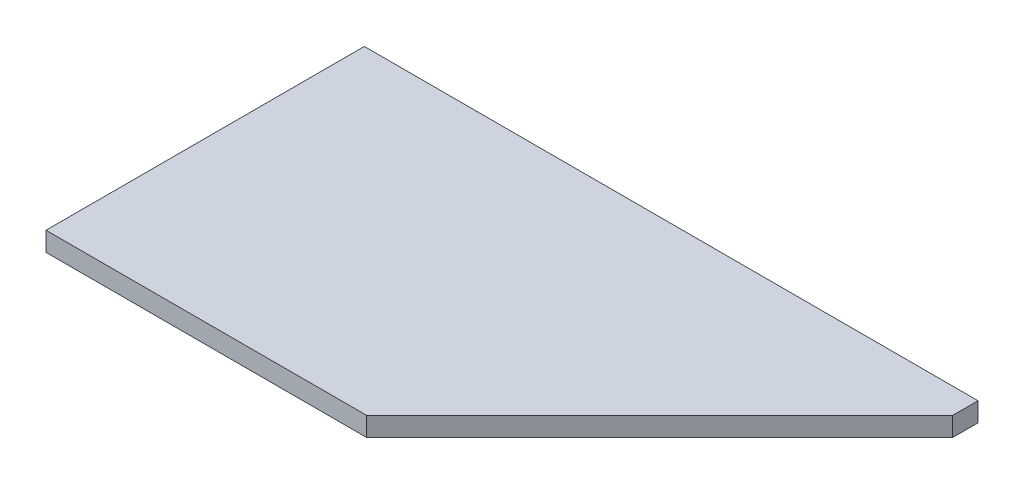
from build123d import *

# Parameters (mm, degrees)
SKETCH_1_W          = 16
SKETCH_1_H          = 8.3
EXTRUDE_1_DEPTH     = 0.5
CUT_EXTRUDE_1_DEPTH = 0.5


with BuildPart() as part:
    # Sketch 1 → Extrude 1 (new body)
    with BuildSketch(Plane(origin=(0, 0, 0), x_dir=(1, 0, 0), z_dir=(0, 1, 0))):
        Rectangle(SKETCH_1_W, SKETCH_1_H)
    extrude(amount=EXTRUDE_1_DEPTH)

    # Sketch 2 → Cut-Extrude 1 (cut)
    with BuildSketch(Plane(origin=(0, 0.5, 0), x_dir=(1, 0, 0), z_dir=(0, 1, 0))):
        Polygon((8, -4.15), (0.362867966, -4.15), (8, 3.487132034), align=None)
    extrude(amount=-CUT_EXTRUDE_1_DEPTH, mode=Mode.SUBTRACT)


solid = part.part
